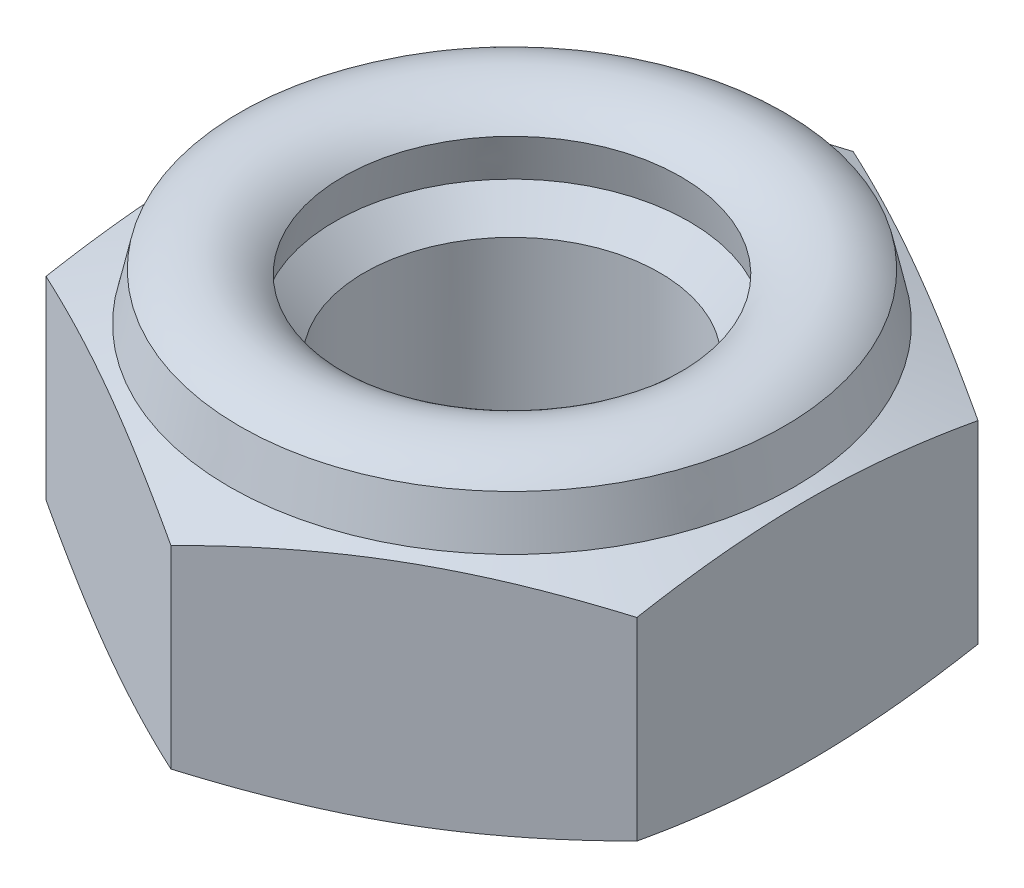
from build123d import *

# Parameters (mm, degrees)
EXTRUDE_1_DEPTH              = 1.6
HOLE_WIZARD_M2_1_D           = 1.6
HOLE_WIZARD_M2_1_DEPTH       = 6
HOLE_WIZARD_M2_1_CBORE_D     = 2
HOLE_WIZARD_M2_1_CBORE_DEPTH = 4
HOLE_WIZARD_M2_1_TIP         = 0.480688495
CHAMFER_1_SIZE               = 0.2


with BuildPart() as part:
    # Sketch 1 → Extrude 1 (new body)
    with BuildSketch(Plane(origin=(0, 0, 0), x_dir=(1, 0, 0), z_dir=(0, 1, 0))):
        Polygon((0, -2.309401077), (2, -1.154700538), (2, 1.154700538), (0, 2.309401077), (-2, 1.154700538), (-2, -1.154700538), align=None)
    extrude(amount=EXTRUDE_1_DEPTH)

    # Hole Wizard M2 _1
    with Locations(Plane(origin=(0, 1.6, 0), x_dir=(-1, 0, 0), z_dir=(0, 1, 0))):
        with Locations((0, 0)):
            CounterBoreHole(HOLE_WIZARD_M2_1_D / 2, HOLE_WIZARD_M2_1_CBORE_D / 2, HOLE_WIZARD_M2_1_CBORE_DEPTH, depth=HOLE_WIZARD_M2_1_DEPTH)
            with Locations((0, 0, -(HOLE_WIZARD_M2_1_DEPTH + HOLE_WIZARD_M2_1_TIP / 2))):  # 118° drill point
                Cone(0, HOLE_WIZARD_M2_1_D / 2, HOLE_WIZARD_M2_1_TIP, mode=Mode.SUBTRACT)

    # Sketch 4 → Cut-Revolve 2 (revolve, cut)
    with BuildSketch(Plane(origin=(0, 0, 0), x_dir=(0, 0, -1), z_dir=(1, 0, 0)), mode=Mode.PRIVATE) as cut_revolve_2_sk:
        Polygon((1.9124112, 0), (2.309401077, 0.144492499), (2.309401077, 0), align=None)
        Polygon((2.309401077, 1.6), (2.309401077, 1.455507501), (1.9124112, 1.6), align=None)
    revolve(cut_revolve_2_sk.sketch.rotate(Axis((0, 3.026713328, 0), (0, -1, 0)), 180), axis=Axis((0, 3.026713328, 0), (0, -1, 0)), mode=Mode.SUBTRACT)

    # Chamfer 1
    chamfer_1_edges = [part.edges().sort_by_distance(p)[0] for p in [
        (1, 0, 0),
        (1, 1.6, 0),
    ]]
    chamfer(chamfer_1_edges, length=CHAMFER_1_SIZE)

    # Sketch 5 → Revolve 1 (revolve)
    with BuildSketch(Plane.XY, mode=Mode.PRIVATE) as revolve_1_sk:
        with BuildLine():
            Line((1.9124112, 1.6), (1.2, 1.6))
            Line((1.2, 1.6), (1.143418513, 1.890796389))
            ThreePointArc((1.143418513, 1.890796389), (1.487091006, 2.040622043), (1.841671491, 1.918838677))
            Line((1.841671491, 1.918838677), (1.9124112, 1.6))
        make_face()
    revolve(revolve_1_sk.sketch.rotate(Axis((0, 0, 0), (0, 1, 0)), 90), axis=Axis((0, 0, 0), (0, 1, 0)))


solid = part.part
